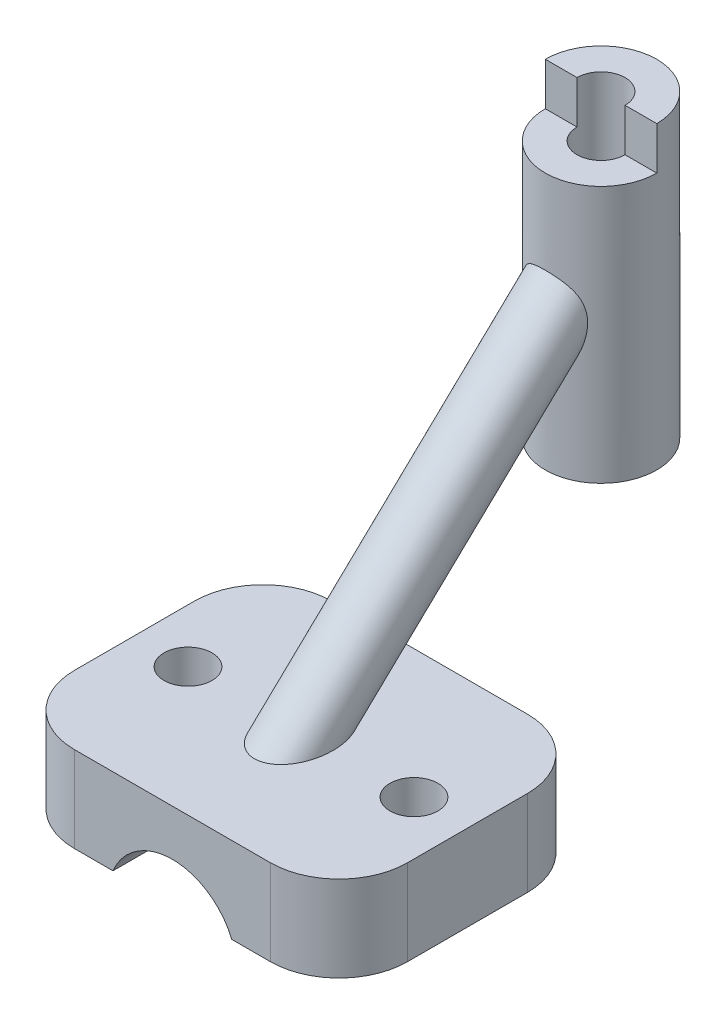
ISO-10303-21;
HEADER;
FILE_DESCRIPTION(('STEP AP214'),'2;1');
FILE_NAME('part.step','',(''),(''),'','','');
FILE_SCHEMA(('AUTOMOTIVE_DESIGN { 1 0 10303 214 1 1 1 1 }'));
ENDSEC;
DATA;
#1=APPLICATION_CONTEXT('core data for automotive mechanical design processes');
#2=APPLICATION_PROTOCOL_DEFINITION('international standard','automotive_design',2000,#1);
#3=PRODUCT_CONTEXT('',#1,'mechanical');
#4=PRODUCT('Part','Part','',(#3));
#5=PRODUCT_RELATED_PRODUCT_CATEGORY('part','',(#4));
#6=PRODUCT_DEFINITION_FORMATION('','',#4);
#7=PRODUCT_DEFINITION_CONTEXT('part definition',#1,'design');
#8=PRODUCT_DEFINITION('design','',#6,#7);
#9=PRODUCT_DEFINITION_SHAPE('','',#8);
#10=(LENGTH_UNIT() NAMED_UNIT(*) SI_UNIT(.MILLI.,.METRE.));
#11=(NAMED_UNIT(*) PLANE_ANGLE_UNIT() SI_UNIT($,.RADIAN.));
#12=(NAMED_UNIT(*) SI_UNIT($,.STERADIAN.) SOLID_ANGLE_UNIT());
#13=UNCERTAINTY_MEASURE_WITH_UNIT(LENGTH_MEASURE(1.E-05),#10,'distance_accuracy_value','');
#14=(GEOMETRIC_REPRESENTATION_CONTEXT(3) GLOBAL_UNCERTAINTY_ASSIGNED_CONTEXT((#13)) GLOBAL_UNIT_ASSIGNED_CONTEXT((#10,
#11,#12)) REPRESENTATION_CONTEXT('',''));
#15=CARTESIAN_POINT('',(0.,0.,0.));
#16=DIRECTION('',(0.,0.,1.));
#17=DIRECTION('',(1.,0.,0.));
#18=AXIS2_PLACEMENT_3D('',#15,#16,#17);
#19=CARTESIAN_POINT('',(-24.67495254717,0.,38.1));
#20=DIRECTION('',(1.,0.,0.));
#21=DIRECTION('',(0.,0.,-1.));
#22=AXIS2_PLACEMENT_3D('',#19,#20,#21);
#23=PLANE('',#22);
#24=DIRECTION('',(0.,0.,-1.));
#25=VECTOR('',#24,1.);
#26=CARTESIAN_POINT('',(-24.67495254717,0.,38.1));
#27=LINE('',#26,#25);
#28=CARTESIAN_POINT('',(-24.67495254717,0.,27.94));
#29=VERTEX_POINT('',#28);
#30=CARTESIAN_POINT('',(-24.67495254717,0.,10.16));
#31=VERTEX_POINT('',#30);
#32=EDGE_CURVE('E309',#29,#31,#27,.T.);
#33=ORIENTED_EDGE('',*,*,#32,.T.);
#34=DIRECTION('',(0.,-1.,0.));
#35=VECTOR('',#34,1.);
#36=CARTESIAN_POINT('',(-24.67495254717,-12.7,10.16));
#37=LINE('',#36,#35);
#38=CARTESIAN_POINT('',(-24.67495254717,-12.7,10.16));
#39=VERTEX_POINT('',#38);
#40=EDGE_CURVE('E340',#31,#39,#37,.T.);
#41=ORIENTED_EDGE('',*,*,#40,.T.);
#42=DIRECTION('',(0.,0.,-1.));
#43=VECTOR('',#42,1.);
#44=CARTESIAN_POINT('',(-24.67495254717,-12.7,38.1));
#45=LINE('',#44,#43);
#46=CARTESIAN_POINT('',(-24.67495254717,-12.7,27.94));
#47=VERTEX_POINT('',#46);
#48=EDGE_CURVE('E334',#47,#39,#45,.T.);
#49=ORIENTED_EDGE('',*,*,#48,.F.);
#50=DIRECTION('',(0.,-1.,0.));
#51=VECTOR('',#50,1.);
#52=CARTESIAN_POINT('',(-24.67495254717,0.,27.94));
#53=LINE('',#52,#51);
#54=EDGE_CURVE('E337',#47,#29,#53,.F.);
#55=ORIENTED_EDGE('',*,*,#54,.T.);
#56=EDGE_LOOP('',(#33,#41,#49,#55));
#57=FACE_BOUND('',#56,.T.);
#58=ADVANCED_FACE('F41',(#57),#23,.F.);
#59=CARTESIAN_POINT('',(-24.67495254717,-12.7,38.1));
#60=DIRECTION('',(0.,1.,0.));
#61=DIRECTION('',(0.,0.,1.));
#62=AXIS2_PLACEMENT_3D('',#59,#60,#61);
#63=PLANE('',#62);
#64=CARTESIAN_POINT('',(-16.73745254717,-12.7,19.05));
#65=DIRECTION('',(0.,-1.,0.));
#66=DIRECTION('',(0.,0.,-1.));
#67=AXIS2_PLACEMENT_3D('',#64,#65,#66);
#68=CIRCLE('',#67,3.556);
#69=CARTESIAN_POINT('',(-16.73745254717,-12.7,15.494));
#70=VERTEX_POINT('',#69);
#71=EDGE_CURVE('E437',#70,#70,#68,.T.);
#72=ORIENTED_EDGE('',*,*,#71,.F.);
#73=EDGE_LOOP('',(#72));
#74=FACE_BOUND('',#73,.T.);
#75=ORIENTED_EDGE('',*,*,#48,.T.);
#76=CARTESIAN_POINT('',(-14.51495254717,-12.7,10.16));
#77=DIRECTION('',(0.,1.,0.));
#78=DIRECTION('',(0.,0.,1.));
#79=AXIS2_PLACEMENT_3D('',#76,#77,#78);
#80=CIRCLE('',#79,10.16);
#81=CARTESIAN_POINT('',(-14.51495254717,-12.7,0.));
#82=VERTEX_POINT('',#81);
#83=EDGE_CURVE('E346',#39,#82,#80,.F.);
#84=ORIENTED_EDGE('',*,*,#83,.T.);
#85=DIRECTION('',(1.,0.,0.));
#86=VECTOR('',#85,1.);
#87=CARTESIAN_POINT('',(-24.67495254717,-12.7,0.));
#88=LINE('',#87,#86);
#89=CARTESIAN_POINT('',(-8.79995254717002,-12.7,0.));
#90=VERTEX_POINT('',#89);
#91=EDGE_CURVE('E310',#82,#90,#88,.T.);
#92=ORIENTED_EDGE('',*,*,#91,.T.);
#93=DIRECTION('',(0.,0.,-1.));
#94=VECTOR('',#93,1.);
#95=CARTESIAN_POINT('',(-8.79995254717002,-12.7,38.1));
#96=LINE('',#95,#94);
#97=CARTESIAN_POINT('',(-8.79995254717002,-12.7,38.1));
#98=VERTEX_POINT('',#97);
#99=EDGE_CURVE('E288',#98,#90,#96,.T.);
#100=ORIENTED_EDGE('',*,*,#99,.F.);
#101=DIRECTION('',(1.,0.,0.));
#102=VECTOR('',#101,1.);
#103=CARTESIAN_POINT('',(-24.67495254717,-12.7,38.1));
#104=LINE('',#103,#102);
#105=CARTESIAN_POINT('',(-14.51495254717,-12.7,38.1));
#106=VERTEX_POINT('',#105);
#107=EDGE_CURVE('E278',#106,#98,#104,.T.);
#108=ORIENTED_EDGE('',*,*,#107,.F.);
#109=CARTESIAN_POINT('',(-14.51495254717,-12.7,27.94));
#110=DIRECTION('',(0.,1.,0.));
#111=DIRECTION('',(0.,0.,1.));
#112=AXIS2_PLACEMENT_3D('',#109,#110,#111);
#113=CIRCLE('',#112,10.16);
#114=EDGE_CURVE('E285',#106,#47,#113,.F.);
#115=ORIENTED_EDGE('',*,*,#114,.T.);
#116=EDGE_LOOP('',(#75,#84,#92,#100,#108,#115));
#117=FACE_BOUND('',#116,.T.);
#118=ADVANCED_FACE('F238',(#74,#117),#63,.F.);
#119=CARTESIAN_POINT('',(0.,-16.3450596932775,38.1));
#120=DIRECTION('',(0.,0.,-1.));
#121=DIRECTION('',(-1.,0.,0.));
#122=AXIS2_PLACEMENT_3D('',#119,#120,#121);
#123=CYLINDRICAL_SURFACE('',#122,9.525);
#124=CARTESIAN_POINT('',(0.,-16.3450596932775,0.));
#125=DIRECTION('',(0.,0.,-1.));
#126=DIRECTION('',(-1.,0.,0.));
#127=AXIS2_PLACEMENT_3D('',#124,#125,#126);
#128=CIRCLE('',#127,9.525);
#129=CARTESIAN_POINT('',(8.79995254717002,-12.7,0.));
#130=VERTEX_POINT('',#129);
#131=EDGE_CURVE('E313',#90,#130,#128,.T.);
#132=ORIENTED_EDGE('',*,*,#131,.T.);
#133=DIRECTION('',(0.,0.,-1.));
#134=VECTOR('',#133,1.);
#135=CARTESIAN_POINT('',(8.79995254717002,-12.7,38.1));
#136=LINE('',#135,#134);
#137=CARTESIAN_POINT('',(8.79995254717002,-12.7,38.1));
#138=VERTEX_POINT('',#137);
#139=EDGE_CURVE('E328',#138,#130,#136,.T.);
#140=ORIENTED_EDGE('',*,*,#139,.F.);
#141=CARTESIAN_POINT('',(0.,-16.3450596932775,38.1));
#142=DIRECTION('',(0.,0.,-1.));
#143=DIRECTION('',(-1.,0.,0.));
#144=AXIS2_PLACEMENT_3D('',#141,#142,#143);
#145=CIRCLE('',#144,9.525);
#146=EDGE_CURVE('E291',#98,#138,#145,.T.);
#147=ORIENTED_EDGE('',*,*,#146,.F.);
#148=ORIENTED_EDGE('',*,*,#99,.T.);
#149=EDGE_LOOP('',(#132,#140,#147,#148));
#150=FACE_BOUND('',#149,.T.);
#151=ADVANCED_FACE('F244',(#150),#123,.F.);
#152=CARTESIAN_POINT('',(24.67495254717,-12.7,38.1));
#153=DIRECTION('',(0.,1.,0.));
#154=DIRECTION('',(0.,0.,1.));
#155=AXIS2_PLACEMENT_3D('',#152,#153,#154);
#156=PLANE('',#155);
#157=CARTESIAN_POINT('',(16.73745254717,-12.7,19.05));
#158=DIRECTION('',(0.,-1.,0.));
#159=DIRECTION('',(0.,0.,1.));
#160=AXIS2_PLACEMENT_3D('',#157,#158,#159);
#161=CIRCLE('',#160,3.556);
#162=CARTESIAN_POINT('',(16.73745254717,-12.7,22.606));
#163=VERTEX_POINT('',#162);
#164=EDGE_CURVE('E432',#163,#163,#161,.T.);
#165=ORIENTED_EDGE('',*,*,#164,.F.);
#166=EDGE_LOOP('',(#165));
#167=FACE_BOUND('',#166,.T.);
#168=DIRECTION('',(1.,0.,0.));
#169=VECTOR('',#168,1.);
#170=CARTESIAN_POINT('',(24.67495254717,-12.7,0.));
#171=LINE('',#170,#169);
#172=CARTESIAN_POINT('',(14.51495254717,-12.7,0.));
#173=VERTEX_POINT('',#172);
#174=EDGE_CURVE('E299',#130,#173,#171,.T.);
#175=ORIENTED_EDGE('',*,*,#174,.T.);
#176=CARTESIAN_POINT('',(14.51495254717,-12.7,10.16));
#177=DIRECTION('',(0.,1.,0.));
#178=DIRECTION('',(0.,0.,1.));
#179=AXIS2_PLACEMENT_3D('',#176,#177,#178);
#180=CIRCLE('',#179,10.16);
#181=CARTESIAN_POINT('',(24.67495254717,-12.7,10.16));
#182=VERTEX_POINT('',#181);
#183=EDGE_CURVE('E63',#173,#182,#180,.F.);
#184=ORIENTED_EDGE('',*,*,#183,.T.);
#185=DIRECTION('',(0.,0.,-1.));
#186=VECTOR('',#185,1.);
#187=CARTESIAN_POINT('',(24.67495254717,-12.7,38.1));
#188=LINE('',#187,#186);
#189=CARTESIAN_POINT('',(24.67495254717,-12.7,27.94));
#190=VERTEX_POINT('',#189);
#191=EDGE_CURVE('E325',#190,#182,#188,.T.);
#192=ORIENTED_EDGE('',*,*,#191,.F.);
#193=CARTESIAN_POINT('',(14.51495254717,-12.7,27.94));
#194=DIRECTION('',(0.,1.,0.));
#195=DIRECTION('',(0.,0.,1.));
#196=AXIS2_PLACEMENT_3D('',#193,#194,#195);
#197=CIRCLE('',#196,10.16);
#198=CARTESIAN_POINT('',(14.51495254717,-12.7,38.1));
#199=VERTEX_POINT('',#198);
#200=EDGE_CURVE('E57',#190,#199,#197,.F.);
#201=ORIENTED_EDGE('',*,*,#200,.T.);
#202=DIRECTION('',(1.,0.,0.));
#203=VECTOR('',#202,1.);
#204=CARTESIAN_POINT('',(24.67495254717,-12.7,38.1));
#205=LINE('',#204,#203);
#206=EDGE_CURVE('E296',#138,#199,#205,.T.);
#207=ORIENTED_EDGE('',*,*,#206,.F.);
#208=ORIENTED_EDGE('',*,*,#139,.T.);
#209=EDGE_LOOP('',(#175,#184,#192,#201,#207,#208));
#210=FACE_BOUND('',#209,.T.);
#211=ADVANCED_FACE('F371',(#167,#210),#156,.F.);
#212=CARTESIAN_POINT('',(24.67495254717,0.,38.1));
#213=DIRECTION('',(-1.,0.,0.));
#214=DIRECTION('',(0.,0.,1.));
#215=AXIS2_PLACEMENT_3D('',#212,#213,#214);
#216=PLANE('',#215);
#217=ORIENTED_EDGE('',*,*,#191,.T.);
#218=DIRECTION('',(0.,1.,0.));
#219=VECTOR('',#218,1.);
#220=CARTESIAN_POINT('',(24.67495254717,0.,10.16));
#221=LINE('',#220,#219);
#222=CARTESIAN_POINT('',(24.67495254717,0.,10.16));
#223=VERTEX_POINT('',#222);
#224=EDGE_CURVE('E263',#182,#223,#221,.T.);
#225=ORIENTED_EDGE('',*,*,#224,.T.);
#226=DIRECTION('',(0.,0.,-1.));
#227=VECTOR('',#226,1.);
#228=CARTESIAN_POINT('',(24.67495254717,0.,38.1));
#229=LINE('',#228,#227);
#230=CARTESIAN_POINT('',(24.67495254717,0.,27.94));
#231=VERTEX_POINT('',#230);
#232=EDGE_CURVE('E321',#231,#223,#229,.T.);
#233=ORIENTED_EDGE('',*,*,#232,.F.);
#234=DIRECTION('',(0.,1.,0.));
#235=VECTOR('',#234,1.);
#236=CARTESIAN_POINT('',(24.67495254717,0.,27.94));
#237=LINE('',#236,#235);
#238=EDGE_CURVE('E261',#231,#190,#237,.F.);
#239=ORIENTED_EDGE('',*,*,#238,.T.);
#240=EDGE_LOOP('',(#217,#225,#233,#239));
#241=FACE_BOUND('',#240,.T.);
#242=ADVANCED_FACE('F369',(#241),#216,.F.);
#243=CARTESIAN_POINT('',(-24.67495254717,0.,38.1));
#244=DIRECTION('',(0.,-1.,0.));
#245=DIRECTION('',(1.,0.,0.));
#246=AXIS2_PLACEMENT_3D('',#243,#244,#245);
#247=PLANE('',#246);
#248=CARTESIAN_POINT('',(0.,0.,19.05));
#249=DIRECTION('',(0.,-1.,0.));
#250=DIRECTION('',(0.,0.,-1.));
#251=AXIS2_PLACEMENT_3D('',#248,#249,#250);
#252=ELLIPSE('',#251,6.89802136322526,4.7625);
#253=CARTESIAN_POINT('',(0.,0.,12.1519786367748));
#254=VERTEX_POINT('',#253);
#255=EDGE_CURVE('E202',#254,#254,#252,.F.);
#256=ORIENTED_EDGE('',*,*,#255,.F.);
#257=EDGE_LOOP('',(#256));
#258=FACE_BOUND('',#257,.T.);
#259=CARTESIAN_POINT('',(-16.73745254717,0.,19.05));
#260=DIRECTION('',(0.,-1.,0.));
#261=DIRECTION('',(1.,0.,0.));
#262=AXIS2_PLACEMENT_3D('',#259,#260,#261);
#263=CIRCLE('',#262,3.556);
#264=CARTESIAN_POINT('',(-13.18145254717,0.,19.05));
#265=VERTEX_POINT('',#264);
#266=EDGE_CURVE('E314',#265,#265,#263,.F.);
#267=ORIENTED_EDGE('',*,*,#266,.F.);
#268=EDGE_LOOP('',(#267));
#269=FACE_BOUND('',#268,.T.);
#270=CARTESIAN_POINT('',(16.73745254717,0.,19.05));
#271=DIRECTION('',(0.,-1.,0.));
#272=DIRECTION('',(1.,0.,0.));
#273=AXIS2_PLACEMENT_3D('',#270,#271,#272);
#274=CIRCLE('',#273,3.556);
#275=CARTESIAN_POINT('',(20.29345254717,0.,19.05));
#276=VERTEX_POINT('',#275);
#277=EDGE_CURVE('E302',#276,#276,#274,.F.);
#278=ORIENTED_EDGE('',*,*,#277,.F.);
#279=EDGE_LOOP('',(#278));
#280=FACE_BOUND('',#279,.T.);
#281=DIRECTION('',(-1.,0.,0.));
#282=VECTOR('',#281,1.);
#283=CARTESIAN_POINT('',(-24.67495254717,0.,0.));
#284=LINE('',#283,#282);
#285=CARTESIAN_POINT('',(14.51495254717,0.,0.));
#286=VERTEX_POINT('',#285);
#287=CARTESIAN_POINT('',(-14.51495254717,0.,0.));
#288=VERTEX_POINT('',#287);
#289=EDGE_CURVE('E292',#286,#288,#284,.T.);
#290=ORIENTED_EDGE('',*,*,#289,.T.);
#291=CARTESIAN_POINT('',(-14.51495254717,0.,10.16));
#292=DIRECTION('',(0.,-1.,0.));
#293=DIRECTION('',(1.,0.,0.));
#294=AXIS2_PLACEMENT_3D('',#291,#292,#293);
#295=CIRCLE('',#294,10.16);
#296=EDGE_CURVE('E364',#288,#31,#295,.F.);
#297=ORIENTED_EDGE('',*,*,#296,.T.);
#298=ORIENTED_EDGE('',*,*,#32,.F.);
#299=CARTESIAN_POINT('',(-14.51495254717,0.,27.94));
#300=DIRECTION('',(0.,-1.,0.));
#301=DIRECTION('',(1.,0.,0.));
#302=AXIS2_PLACEMENT_3D('',#299,#300,#301);
#303=CIRCLE('',#302,10.16);
#304=CARTESIAN_POINT('',(-14.51495254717,0.,38.1));
#305=VERTEX_POINT('',#304);
#306=EDGE_CURVE('E355',#29,#305,#303,.F.);
#307=ORIENTED_EDGE('',*,*,#306,.T.);
#308=DIRECTION('',(-1.,0.,0.));
#309=VECTOR('',#308,1.);
#310=CARTESIAN_POINT('',(-24.67495254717,0.,38.1));
#311=LINE('',#310,#309);
#312=CARTESIAN_POINT('',(14.51495254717,0.,38.1));
#313=VERTEX_POINT('',#312);
#314=EDGE_CURVE('E281',#313,#305,#311,.T.);
#315=ORIENTED_EDGE('',*,*,#314,.F.);
#316=CARTESIAN_POINT('',(14.51495254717,0.,27.94));
#317=DIRECTION('',(0.,-1.,0.));
#318=DIRECTION('',(1.,0.,0.));
#319=AXIS2_PLACEMENT_3D('',#316,#317,#318);
#320=CIRCLE('',#319,10.16);
#321=EDGE_CURVE('E358',#313,#231,#320,.F.);
#322=ORIENTED_EDGE('',*,*,#321,.T.);
#323=ORIENTED_EDGE('',*,*,#232,.T.);
#324=CARTESIAN_POINT('',(14.51495254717,0.,10.16));
#325=DIRECTION('',(0.,-1.,0.));
#326=DIRECTION('',(1.,0.,0.));
#327=AXIS2_PLACEMENT_3D('',#324,#325,#326);
#328=CIRCLE('',#327,10.16);
#329=EDGE_CURVE('E361',#223,#286,#328,.F.);
#330=ORIENTED_EDGE('',*,*,#329,.T.);
#331=EDGE_LOOP('',(#290,#297,#298,#307,#315,#322,#323,#330));
#332=FACE_BOUND('',#331,.T.);
#333=ADVANCED_FACE('F380',(#258,#269,#280,#332),#247,.F.);
#334=CARTESIAN_POINT('',(0.,-16.3450596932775,38.1));
#335=DIRECTION('',(0.,0.,-1.));
#336=DIRECTION('',(-1.,0.,0.));
#337=AXIS2_PLACEMENT_3D('',#334,#335,#336);
#338=PLANE('',#337);
#339=ORIENTED_EDGE('',*,*,#206,.T.);
#340=DIRECTION('',(0.,1.,0.));
#341=VECTOR('',#340,1.);
#342=CARTESIAN_POINT('',(14.51495254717,-16.3450596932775,38.1));
#343=LINE('',#342,#341);
#344=EDGE_CURVE('E11',#199,#313,#343,.T.);
#345=ORIENTED_EDGE('',*,*,#344,.T.);
#346=ORIENTED_EDGE('',*,*,#314,.T.);
#347=DIRECTION('',(0.,-1.,0.));
#348=VECTOR('',#347,1.);
#349=CARTESIAN_POINT('',(-14.51495254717,-16.3450596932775,38.1));
#350=LINE('',#349,#348);
#351=EDGE_CURVE('E50',#305,#106,#350,.T.);
#352=ORIENTED_EDGE('',*,*,#351,.T.);
#353=ORIENTED_EDGE('',*,*,#107,.T.);
#354=ORIENTED_EDGE('',*,*,#146,.T.);
#355=EDGE_LOOP('',(#339,#345,#346,#352,#353,#354));
#356=FACE_BOUND('',#355,.T.);
#357=ADVANCED_FACE('F277',(#356),#338,.F.);
#358=CARTESIAN_POINT('',(0.,-16.3450596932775,0.));
#359=DIRECTION('',(0.,0.,-1.));
#360=DIRECTION('',(-1.,0.,0.));
#361=AXIS2_PLACEMENT_3D('',#358,#359,#360);
#362=PLANE('',#361);
#363=ORIENTED_EDGE('',*,*,#91,.F.);
#364=DIRECTION('',(0.,-1.,0.));
#365=VECTOR('',#364,1.);
#366=CARTESIAN_POINT('',(-14.51495254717,0.,0.));
#367=LINE('',#366,#365);
#368=EDGE_CURVE('E352',#82,#288,#367,.F.);
#369=ORIENTED_EDGE('',*,*,#368,.T.);
#370=ORIENTED_EDGE('',*,*,#289,.F.);
#371=DIRECTION('',(0.,1.,0.));
#372=VECTOR('',#371,1.);
#373=CARTESIAN_POINT('',(14.51495254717,-12.7,0.));
#374=LINE('',#373,#372);
#375=EDGE_CURVE('E349',#286,#173,#374,.F.);
#376=ORIENTED_EDGE('',*,*,#375,.T.);
#377=ORIENTED_EDGE('',*,*,#174,.F.);
#378=ORIENTED_EDGE('',*,*,#131,.F.);
#379=EDGE_LOOP('',(#363,#369,#370,#376,#377,#378));
#380=FACE_BOUND('',#379,.T.);
#381=ADVANCED_FACE('F388',(#380),#362,.T.);
#382=CARTESIAN_POINT('',(16.73745254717,0.000999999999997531,19.05));
#383=DIRECTION('',(0.,-1.,0.));
#384=DIRECTION('',(0.,0.,-1.));
#385=AXIS2_PLACEMENT_3D('',#382,#383,#384);
#386=CYLINDRICAL_SURFACE('',#385,3.556);
#387=ORIENTED_EDGE('',*,*,#164,.T.);
#388=EDGE_LOOP('',(#387));
#389=FACE_BOUND('',#388,.T.);
#390=ORIENTED_EDGE('',*,*,#277,.T.);
#391=EDGE_LOOP('',(#390));
#392=FACE_BOUND('',#391,.T.);
#393=ADVANCED_FACE('F391',(#389,#392),#386,.F.);
#394=CARTESIAN_POINT('',(-16.73745254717,0.000999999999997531,19.05));
#395=DIRECTION('',(0.,-1.,0.));
#396=DIRECTION('',(0.,0.,-1.));
#397=AXIS2_PLACEMENT_3D('',#394,#395,#396);
#398=CYLINDRICAL_SURFACE('',#397,3.556);
#399=ORIENTED_EDGE('',*,*,#71,.T.);
#400=EDGE_LOOP('',(#399));
#401=FACE_BOUND('',#400,.T.);
#402=ORIENTED_EDGE('',*,*,#266,.T.);
#403=EDGE_LOOP('',(#402));
#404=FACE_BOUND('',#403,.T.);
#405=ADVANCED_FACE('F397',(#401,#404),#398,.F.);
#406=CARTESIAN_POINT('',(0.,-15.569761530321,35.3639045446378));
#407=DIRECTION('',(0.,0.690415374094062,-0.723413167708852));
#408=DIRECTION('',(0.,0.723413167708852,0.690415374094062));
#409=AXIS2_PLACEMENT_3D('',#406,#407,#408);
#410=CYLINDRICAL_SURFACE('',#409,4.7625);
#411=ORIENTED_EDGE('',*,*,#255,.T.);
#412=EDGE_LOOP('',(#411));
#413=FACE_BOUND('',#412,.T.);
#414=CARTESIAN_POINT('',(0.,27.9606252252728,-17.145));
#415=CARTESIAN_POINT('',(-0.143002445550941,27.9606405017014,-17.1450049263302));
#416=CARTESIAN_POINT('',(-0.286241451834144,27.973227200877,-17.1487650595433));
#417=CARTESIAN_POINT('',(-0.56834270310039,28.0222470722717,-17.1633670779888));
#418=CARTESIAN_POINT('',(-0.707192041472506,28.0587447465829,-17.1742281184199));
#419=CARTESIAN_POINT('',(-1.00992237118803,28.1635648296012,-17.205275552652));
#420=CARTESIAN_POINT('',(-1.17168538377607,28.2374660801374,-17.2270868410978));
#421=CARTESIAN_POINT('',(-1.48069049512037,28.4092421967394,-17.2773615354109));
#422=CARTESIAN_POINT('',(-1.62790786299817,28.5071569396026,-17.3058360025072));
#423=CARTESIAN_POINT('',(-1.87952793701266,28.6988615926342,-17.36100431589));
#424=CARTESIAN_POINT('',(-1.98657333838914,28.7894919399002,-17.3868966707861));
#425=CARTESIAN_POINT('',(-2.19211253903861,28.9795152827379,-17.4406681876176));
#426=CARTESIAN_POINT('',(-2.29060088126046,29.078913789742,-17.4685485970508));
#427=CARTESIAN_POINT('',(-2.47981172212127,29.2847487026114,-17.5256529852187));
#428=CARTESIAN_POINT('',(-2.57052090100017,29.3911966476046,-17.5548791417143));
#429=CARTESIAN_POINT('',(-2.74471737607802,29.6096631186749,-17.6141150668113));
#430=CARTESIAN_POINT('',(-2.82820196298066,29.7216837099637,-17.6441251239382));
#431=CARTESIAN_POINT('',(-3.05607689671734,30.0464509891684,-17.7299019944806));
#432=CARTESIAN_POINT('',(-3.19259622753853,30.2646278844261,-17.7860904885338));
#433=CARTESIAN_POINT('',(-3.44644717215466,30.7121416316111,-17.8975871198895));
#434=CARTESIAN_POINT('',(-3.56376250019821,30.9414877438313,-17.9528944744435));
#435=CARTESIAN_POINT('',(-3.78158481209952,31.4094511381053,-18.0610995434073));
#436=CARTESIAN_POINT('',(-3.88203813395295,31.6480951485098,-18.1139891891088));
#437=CARTESIAN_POINT('',(-4.06695476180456,32.1322459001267,-18.2155715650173));
#438=CARTESIAN_POINT('',(-4.15142314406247,32.3777504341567,-18.2642656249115));
#439=CARTESIAN_POINT('',(-4.31174611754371,32.8965279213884,-18.3598771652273));
#440=CARTESIAN_POINT('',(-4.38618287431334,33.1703395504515,-18.4062587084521));
#441=CARTESIAN_POINT('',(-4.51657410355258,33.7238918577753,-18.4897484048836));
#442=CARTESIAN_POINT('',(-4.57252018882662,34.003635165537,-18.526852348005));
#443=CARTESIAN_POINT('',(-4.66425600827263,34.5665881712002,-18.5887746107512));
#444=CARTESIAN_POINT('',(-4.70012944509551,34.8497783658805,-18.6136438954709));
#445=CARTESIAN_POINT('',(-4.74929964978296,35.4189764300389,-18.6479518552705));
#446=CARTESIAN_POINT('',(-4.76262013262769,35.7049810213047,-18.6574067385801));
#447=CARTESIAN_POINT('',(-4.76243653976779,36.139428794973,-18.6572871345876));
#448=CARTESIAN_POINT('',(-4.75874877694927,36.2879124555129,-18.654675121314));
#449=CARTESIAN_POINT('',(-4.74333038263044,36.584237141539,-18.6438215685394));
#450=CARTESIAN_POINT('',(-4.73160253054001,36.7320783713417,-18.6355819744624));
#451=CARTESIAN_POINT('',(-4.6992518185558,37.0262691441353,-18.6130680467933));
#452=CARTESIAN_POINT('',(-4.67863338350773,37.172619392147,-18.5987967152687));
#453=CARTESIAN_POINT('',(-4.62759144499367,37.4628725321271,-18.5639645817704));
#454=CARTESIAN_POINT('',(-4.59716778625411,37.6067753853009,-18.5434036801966));
#455=CARTESIAN_POINT('',(-4.52519925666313,37.8926349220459,-18.4956908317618));
#456=CARTESIAN_POINT('',(-4.48352119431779,38.0345453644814,-18.4684603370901));
#457=CARTESIAN_POINT('',(-4.3884658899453,38.3130725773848,-18.4078926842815));
#458=CARTESIAN_POINT('',(-4.33508884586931,38.449689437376,-18.3745556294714));
#459=CARTESIAN_POINT('',(-4.21619647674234,38.7159615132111,-18.3025686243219));
#460=CARTESIAN_POINT('',(-4.15069022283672,38.8456218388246,-18.2639226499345));
#461=CARTESIAN_POINT('',(-4.00739274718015,39.0965787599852,-18.1824791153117));
#462=CARTESIAN_POINT('',(-3.92960327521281,39.2178765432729,-18.1396821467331));
#463=CARTESIAN_POINT('',(-3.77346177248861,39.4349194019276,-18.0574736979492));
#464=CARTESIAN_POINT('',(-3.69663443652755,39.5318928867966,-18.0183969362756));
#465=CARTESIAN_POINT('',(-3.53441676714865,39.7180032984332,-17.9393660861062));
#466=CARTESIAN_POINT('',(-3.44902674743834,39.8071405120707,-17.8994120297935));
#467=CARTESIAN_POINT('',(-3.27021605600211,39.9771183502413,-17.8197432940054));
#468=CARTESIAN_POINT('',(-3.17679344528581,40.0579569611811,-17.7800286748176));
#469=CARTESIAN_POINT('',(-2.98260601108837,40.2110021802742,-17.701946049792));
#470=CARTESIAN_POINT('',(-2.88184115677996,40.2832087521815,-17.6635780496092));
#471=CARTESIAN_POINT('',(-2.67883228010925,40.41548091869,-17.5910354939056));
#472=CARTESIAN_POINT('',(-2.57690278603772,40.4759681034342,-17.5567475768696));
#473=CARTESIAN_POINT('',(-2.36774775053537,40.5889156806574,-17.4910928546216));
#474=CARTESIAN_POINT('',(-2.2605205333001,40.6413735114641,-17.4597269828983));
#475=CARTESIAN_POINT('',(-2.04156409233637,40.7381966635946,-17.4006316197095));
#476=CARTESIAN_POINT('',(-1.9298366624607,40.7825651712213,-17.3729006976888));
#477=CARTESIAN_POINT('',(-1.70253352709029,40.8632592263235,-17.3216348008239));
#478=CARTESIAN_POINT('',(-1.58695639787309,40.8995817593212,-17.2981013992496));
#479=CARTESIAN_POINT('',(-1.34750290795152,40.9656306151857,-17.2547734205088));
#480=CARTESIAN_POINT('',(-1.22348642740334,40.9949898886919,-17.2351927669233));
#481=CARTESIAN_POINT('',(-0.972924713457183,41.0449736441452,-17.2015594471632));
#482=CARTESIAN_POINT('',(-0.846378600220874,41.0655950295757,-17.1875087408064));
#483=CARTESIAN_POINT('',(-0.591664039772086,41.098115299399,-17.165238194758));
#484=CARTESIAN_POINT('',(-0.463495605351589,41.1100142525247,-17.1570183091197));
#485=CARTESIAN_POINT('',(-0.206403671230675,41.1251070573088,-17.1465779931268));
#486=CARTESIAN_POINT('',(-0.077480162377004,41.1283008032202,-17.1443576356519));
#487=CARTESIAN_POINT('',(0.183287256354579,41.1259603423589,-17.1459811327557));
#488=CARTESIAN_POINT('',(0.315128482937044,41.1202189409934,-17.1499689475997));
#489=CARTESIAN_POINT('',(0.577712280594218,41.0996154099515,-17.1641906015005));
#490=CARTESIAN_POINT('',(0.70845520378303,41.0847563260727,-17.1744223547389));
#491=CARTESIAN_POINT('',(0.968019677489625,41.0458890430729,-17.200915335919));
#492=CARTESIAN_POINT('',(1.09684029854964,41.0218765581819,-17.2171793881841));
#493=CARTESIAN_POINT('',(1.35152184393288,40.9646828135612,-17.2553706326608));
#494=CARTESIAN_POINT('',(1.47738389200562,40.9315050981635,-17.2772956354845));
#495=CARTESIAN_POINT('',(1.72535205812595,40.8559220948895,-17.3263287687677));
#496=CARTESIAN_POINT('',(1.84745601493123,40.8135116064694,-17.3534398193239));
#497=CARTESIAN_POINT('',(2.08687625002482,40.7194690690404,-17.4121868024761));
#498=CARTESIAN_POINT('',(2.20419443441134,40.6678407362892,-17.4438209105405));
#499=CARTESIAN_POINT('',(2.43320797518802,40.5553531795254,-17.5108454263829));
#500=CARTESIAN_POINT('',(2.54490309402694,40.4944935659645,-17.5462359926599));
#501=CARTESIAN_POINT('',(2.76179778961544,40.3636048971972,-17.6198577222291));
#502=CARTESIAN_POINT('',(2.86699755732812,40.2935761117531,-17.6580888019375));
#503=CARTESIAN_POINT('',(3.0675679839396,40.1463439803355,-17.735385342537));
#504=CARTESIAN_POINT('',(3.16311751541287,40.069361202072,-17.7744067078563));
#505=CARTESIAN_POINT('',(3.34656814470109,39.9070701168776,-17.8531151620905));
#506=CARTESIAN_POINT('',(3.4344694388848,39.821762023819,-17.892802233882));
#507=CARTESIAN_POINT('',(3.6019835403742,39.643275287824,-17.9717222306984));
#508=CARTESIAN_POINT('',(3.68160131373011,39.550101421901,-18.0109554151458));
#509=CARTESIAN_POINT('',(3.83215950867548,39.3564096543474,-18.0879052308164));
#510=CARTESIAN_POINT('',(3.90310020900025,39.2558919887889,-18.1256219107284));
#511=CARTESIAN_POINT('',(4.03306920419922,39.0528904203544,-18.1969015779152));
#512=CARTESIAN_POINT('',(4.09248793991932,38.9506946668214,-18.2305748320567));
#513=CARTESIAN_POINT('',(4.20313021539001,38.7409959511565,-18.2948737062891));
#514=CARTESIAN_POINT('',(4.25435061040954,38.6334909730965,-18.3254981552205));
#515=CARTESIAN_POINT('',(4.34868153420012,38.4140537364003,-18.3830882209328));
#516=CARTESIAN_POINT('',(4.39179264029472,38.3021217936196,-18.4100540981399));
#517=CARTESIAN_POINT('',(4.47019103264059,38.0746635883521,-18.4599299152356));
#518=CARTESIAN_POINT('',(4.50547664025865,37.959136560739,-18.482838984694));
#519=CARTESIAN_POINT('',(4.57899077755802,37.6868725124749,-18.5312001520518));
#520=CARTESIAN_POINT('',(4.61437447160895,37.5290713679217,-18.5550130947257));
#521=CARTESIAN_POINT('',(4.67314220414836,37.2103062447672,-18.5950003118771));
#522=CARTESIAN_POINT('',(4.69652243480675,37.0493412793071,-18.6111721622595));
#523=CARTESIAN_POINT('',(4.73251986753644,36.7254005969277,-18.6362169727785));
#524=CARTESIAN_POINT('',(4.74511863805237,36.5624219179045,-18.6450774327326));
#525=CARTESIAN_POINT('',(4.76064206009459,36.235761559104,-18.656010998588));
#526=CARTESIAN_POINT('',(4.76356323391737,36.0720796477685,-18.6580816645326));
#527=CARTESIAN_POINT('',(4.75995189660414,35.6509695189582,-18.6555253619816));
#528=CARTESIAN_POINT('',(4.74703673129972,35.3936145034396,-18.6463761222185));
#529=CARTESIAN_POINT('',(4.70291591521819,34.8812101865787,-18.6155850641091));
#530=CARTESIAN_POINT('',(4.67169840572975,34.6261624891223,-18.5939351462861));
#531=CARTESIAN_POINT('',(4.59290169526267,34.1188544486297,-18.540513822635));
#532=CARTESIAN_POINT('',(4.54526886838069,33.8666060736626,-18.5087092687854));
#533=CARTESIAN_POINT('',(4.43486210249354,33.3666983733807,-18.4371452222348));
#534=CARTESIAN_POINT('',(4.3720920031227,33.1190379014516,-18.3973877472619));
#535=CARTESIAN_POINT('',(4.22684502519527,32.611640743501,-18.3086980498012));
#536=CARTESIAN_POINT('',(4.14328675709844,32.3522921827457,-18.2593152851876));
#537=CARTESIAN_POINT('',(3.95886968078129,31.8407238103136,-18.1554436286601));
#538=CARTESIAN_POINT('',(3.85800357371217,31.5885070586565,-18.1009525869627));
#539=CARTESIAN_POINT('',(3.63824187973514,31.0941715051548,-17.9889690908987));
#540=CARTESIAN_POINT('',(3.51943295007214,30.8520109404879,-17.9314918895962));
#541=CARTESIAN_POINT('',(3.26131370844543,30.3793541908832,-17.8152169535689));
#542=CARTESIAN_POINT('',(3.12202422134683,30.1488464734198,-17.7564206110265));
#543=CARTESIAN_POINT('',(2.84901639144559,29.7471718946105,-17.6511206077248));
#544=CARTESIAN_POINT('',(2.71950895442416,29.5731991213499,-17.6044557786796));
#545=CARTESIAN_POINT('',(2.44231039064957,29.2390055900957,-17.5132063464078));
#546=CARTESIAN_POINT('',(2.29459477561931,29.0788038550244,-17.4686246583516));
#547=CARTESIAN_POINT('',(2.05661549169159,28.8528402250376,-17.4048662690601));
#548=CARTESIAN_POINT('',(1.97399388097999,28.7795022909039,-17.3840138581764));
#549=CARTESIAN_POINT('',(1.80318551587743,28.6391803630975,-17.3438669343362));
#550=CARTESIAN_POINT('',(1.71499770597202,28.5721975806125,-17.3245727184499));
#551=CARTESIAN_POINT('',(1.44206986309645,28.3831500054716,-17.2698289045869));
#552=CARTESIAN_POINT('',(1.24832109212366,28.2723479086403,-17.2373366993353));
#553=CARTESIAN_POINT('',(0.913387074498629,28.1275417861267,-17.1946277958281));
#554=CARTESIAN_POINT('',(0.778401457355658,28.0802508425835,-17.1806030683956));
#555=CARTESIAN_POINT('',(0.502207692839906,28.0080152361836,-17.1591374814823));
#556=CARTESIAN_POINT('',(0.361020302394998,27.9830012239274,-17.1516761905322));
#557=CARTESIAN_POINT('',(0.1824706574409,27.9671114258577,-17.146935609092));
#558=CARTESIAN_POINT('',(0.146029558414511,27.9646833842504,-17.1462111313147));
#559=CARTESIAN_POINT('',(0.0730641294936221,27.9614382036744,-17.1452426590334));
#560=CARTESIAN_POINT('',(0.0365397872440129,27.9606213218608,-17.1449987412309));
#561=CARTESIAN_POINT('',(0.,27.9606252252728,-17.145));
#562=B_SPLINE_CURVE_WITH_KNOTS('',3,(#414,#415,#416,#417,#418,#419,#420,#421,#422,#423,#424,
#425,#426,#427,#428,#429,#430,#431,#432,#433,#434,#435,#436,#437,#438,#439,#440,#441,#442,#443,
#444,#445,#446,#447,#448,#449,#450,#451,#452,#453,#454,#455,#456,#457,#458,#459,#460,#461,#462,
#463,#464,#465,#466,#467,#468,#469,#470,#471,#472,#473,#474,#475,#476,#477,#478,#479,#480,#481,
#482,#483,#484,#485,#486,#487,#488,#489,#490,#491,#492,#493,#494,#495,#496,#497,#498,#499,#500,
#501,#502,#503,#504,#505,#506,#507,#508,#509,#510,#511,#512,#513,#514,#515,#516,#517,#518,#519,
#520,#521,#522,#523,#524,#525,#526,#527,#528,#529,#530,#531,#532,#533,#534,#535,#536,#537,#538,
#539,#540,#541,#542,#543,#544,#545,#546,#547,#548,#549,#550,#551,#552,#553,#554,#555,#556,#557,
#558,#559,#560,#561),.UNSPECIFIED.,.T.,.F.,(4,2,2,2,2,2,2,2,2,2,2,2,2,2,2,2,2,2,2,2,2,2,2,2,2,2,
2,2,2,2,2,2,2,2,2,2,2,2,2,2,2,2,2,2,2,2,2,2,2,2,2,2,2,2,2,2,2,2,2,2,2,2,2,2,2,2,2,2,2,2,2,2,2,
4),(0.,0.428850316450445,0.858862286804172,1.39338495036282,1.92880132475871,2.35610189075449,
2.7836729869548,3.21196214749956,3.64041123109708,4.42943207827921,5.21911861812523,
6.01127249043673,6.80317437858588,7.66495562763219,8.52712723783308,9.38567628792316,
10.2433219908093,10.6887130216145,11.1339501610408,11.5789659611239,12.0239888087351,
12.4745284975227,12.9250605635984,13.3752570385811,13.8253894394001,14.2141094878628,
14.6028153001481,14.9916152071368,15.3804167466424,15.7501631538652,16.1200272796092,
16.4897454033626,16.8596018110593,17.245976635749,17.6324882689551,18.0189968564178,
18.4055101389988,18.8011205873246,19.1965989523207,19.5922627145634,19.9877736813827,
20.383508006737,20.7790831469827,21.174674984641,21.5702551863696,21.9560410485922,
22.3418170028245,22.727360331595,23.1128912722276,23.4812095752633,23.8496688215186,
24.2181018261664,24.5866137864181,25.07625174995,25.5660449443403,26.0566738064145,
26.5474789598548,27.3197679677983,28.0925579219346,28.8678967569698,29.643039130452,
30.4731184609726,31.3035487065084,32.1300894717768,32.9557955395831,33.6204754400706,
34.2860592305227,34.6230298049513,34.9600644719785,35.6313885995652,36.0609383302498,
36.4891461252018,36.5987078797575,36.7082871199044),.UNSPECIFIED.);
#563=CARTESIAN_POINT('',(0.,27.9606252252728,-17.145));
#564=VERTEX_POINT('',#563);
#565=EDGE_CURVE('E190',#564,#564,#562,.T.);
#566=ORIENTED_EDGE('',*,*,#565,.F.);
#567=EDGE_LOOP('',(#566));
#568=FACE_BOUND('',#567,.T.);
#569=ADVANCED_FACE('F219',(#413,#568),#410,.T.);
#570=CARTESIAN_POINT('',(0.,53.594,-25.4));
#571=DIRECTION('',(0.,1.,0.));
#572=DIRECTION('',(-1.,0.,0.));
#573=AXIS2_PLACEMENT_3D('',#570,#571,#572);
#574=PLANE('',#573);
#575=DIRECTION('',(1.,0.,0.));
#576=VECTOR('',#575,1.);
#577=CARTESIAN_POINT('',(-3.556,53.594,-25.4));
#578=LINE('',#577,#576);
#579=CARTESIAN_POINT('',(-8.255,53.594,-25.4));
#580=VERTEX_POINT('',#579);
#581=CARTESIAN_POINT('',(-3.556,53.594,-25.4));
#582=VERTEX_POINT('',#581);
#583=EDGE_CURVE('E167',#580,#582,#578,.T.);
#584=ORIENTED_EDGE('',*,*,#583,.F.);
#585=CARTESIAN_POINT('',(0.,53.594,-25.4));
#586=DIRECTION('',(0.,1.,0.));
#587=DIRECTION('',(-1.,0.,0.));
#588=AXIS2_PLACEMENT_3D('',#585,#586,#587);
#589=CIRCLE('',#588,8.255);
#590=CARTESIAN_POINT('',(8.255,53.594,-25.4));
#591=VERTEX_POINT('',#590);
#592=EDGE_CURVE('E187',#580,#591,#589,.T.);
#593=ORIENTED_EDGE('',*,*,#592,.T.);
#594=DIRECTION('',(1.,0.,0.));
#595=VECTOR('',#594,1.);
#596=CARTESIAN_POINT('',(3.556,53.594,-25.4));
#597=LINE('',#596,#595);
#598=CARTESIAN_POINT('',(3.556,53.594,-25.4));
#599=VERTEX_POINT('',#598);
#600=EDGE_CURVE('E425',#599,#591,#597,.T.);
#601=ORIENTED_EDGE('',*,*,#600,.F.);
#602=CARTESIAN_POINT('',(0.,53.594,-25.4));
#603=DIRECTION('',(0.,1.,0.));
#604=DIRECTION('',(-1.,0.,0.));
#605=AXIS2_PLACEMENT_3D('',#602,#603,#604);
#606=CIRCLE('',#605,3.556);
#607=EDGE_CURVE('E172',#582,#599,#606,.T.);
#608=ORIENTED_EDGE('',*,*,#607,.F.);
#609=EDGE_LOOP('',(#584,#593,#601,#608));
#610=FACE_BOUND('',#609,.T.);
#611=ADVANCED_FACE('F215',(#610),#574,.T.);
#612=CARTESIAN_POINT('',(0.,15.494,-25.4));
#613=DIRECTION('',(0.,1.,0.));
#614=DIRECTION('',(-1.,0.,0.));
#615=AXIS2_PLACEMENT_3D('',#612,#613,#614);
#616=PLANE('',#615);
#617=CARTESIAN_POINT('',(0.,15.494,-25.4));
#618=DIRECTION('',(0.,1.,0.));
#619=DIRECTION('',(-1.,0.,0.));
#620=AXIS2_PLACEMENT_3D('',#617,#618,#619);
#621=CIRCLE('',#620,8.255);
#622=CARTESIAN_POINT('',(-8.255,15.494,-25.4));
#623=VERTEX_POINT('',#622);
#624=EDGE_CURVE('E185',#623,#623,#621,.T.);
#625=ORIENTED_EDGE('',*,*,#624,.F.);
#626=EDGE_LOOP('',(#625));
#627=FACE_BOUND('',#626,.T.);
#628=CARTESIAN_POINT('',(0.,15.494,-25.4));
#629=DIRECTION('',(0.,1.,0.));
#630=DIRECTION('',(-1.,0.,0.));
#631=AXIS2_PLACEMENT_3D('',#628,#629,#630);
#632=CIRCLE('',#631,3.556);
#633=CARTESIAN_POINT('',(-3.556,15.494,-25.4));
#634=VERTEX_POINT('',#633);
#635=EDGE_CURVE('E174',#634,#634,#632,.T.);
#636=ORIENTED_EDGE('',*,*,#635,.T.);
#637=EDGE_LOOP('',(#636));
#638=FACE_BOUND('',#637,.T.);
#639=ADVANCED_FACE('F211',(#627,#638),#616,.F.);
#640=CARTESIAN_POINT('',(0.,53.594,-25.4));
#641=DIRECTION('',(0.,-1.,0.));
#642=DIRECTION('',(1.,0.,0.));
#643=AXIS2_PLACEMENT_3D('',#640,#641,#642);
#644=CYLINDRICAL_SURFACE('',#643,8.255);
#645=ORIENTED_EDGE('',*,*,#565,.T.);
#646=EDGE_LOOP('',(#645));
#647=FACE_BOUND('',#646,.T.);
#648=ORIENTED_EDGE('',*,*,#592,.F.);
#649=DIRECTION('',(0.,-1.,0.));
#650=VECTOR('',#649,1.);
#651=CARTESIAN_POINT('',(-8.255,59.944,-25.4));
#652=LINE('',#651,#650);
#653=CARTESIAN_POINT('',(-8.255,59.944,-25.4));
#654=VERTEX_POINT('',#653);
#655=EDGE_CURVE('E180',#654,#580,#652,.T.);
#656=ORIENTED_EDGE('',*,*,#655,.F.);
#657=CARTESIAN_POINT('',(0.,59.944,-25.4));
#658=DIRECTION('',(0.,1.,0.));
#659=DIRECTION('',(1.,0.,0.));
#660=AXIS2_PLACEMENT_3D('',#657,#658,#659);
#661=CIRCLE('',#660,8.255);
#662=CARTESIAN_POINT('',(8.255,59.944,-25.4));
#663=VERTEX_POINT('',#662);
#664=EDGE_CURVE('E156',#663,#654,#661,.T.);
#665=ORIENTED_EDGE('',*,*,#664,.F.);
#666=DIRECTION('',(0.,-1.,0.));
#667=VECTOR('',#666,1.);
#668=CARTESIAN_POINT('',(8.255,59.944,-25.4));
#669=LINE('',#668,#667);
#670=EDGE_CURVE('E152',#663,#591,#669,.T.);
#671=ORIENTED_EDGE('',*,*,#670,.T.);
#672=EDGE_LOOP('',(#648,#656,#665,#671));
#673=FACE_BOUND('',#672,.T.);
#674=ORIENTED_EDGE('',*,*,#624,.T.);
#675=EDGE_LOOP('',(#674));
#676=FACE_BOUND('',#675,.T.);
#677=ADVANCED_FACE('F208',(#647,#673,#676),#644,.T.);
#678=CARTESIAN_POINT('',(0.,53.594,-25.4));
#679=DIRECTION('',(0.,-1.,0.));
#680=DIRECTION('',(1.,0.,0.));
#681=AXIS2_PLACEMENT_3D('',#678,#679,#680);
#682=CYLINDRICAL_SURFACE('',#681,3.556);
#683=ORIENTED_EDGE('',*,*,#607,.T.);
#684=DIRECTION('',(0.,-1.,0.));
#685=VECTOR('',#684,1.);
#686=CARTESIAN_POINT('',(3.556,59.944,-25.4));
#687=LINE('',#686,#685);
#688=CARTESIAN_POINT('',(3.556,59.944,-25.4));
#689=VERTEX_POINT('',#688);
#690=EDGE_CURVE('E150',#689,#599,#687,.T.);
#691=ORIENTED_EDGE('',*,*,#690,.F.);
#692=CARTESIAN_POINT('',(0.,59.944,-25.4));
#693=DIRECTION('',(0.,-1.,0.));
#694=DIRECTION('',(1.,0.,0.));
#695=AXIS2_PLACEMENT_3D('',#692,#693,#694);
#696=CIRCLE('',#695,3.556);
#697=CARTESIAN_POINT('',(-3.556,59.944,-25.4));
#698=VERTEX_POINT('',#697);
#699=EDGE_CURVE('E157',#698,#689,#696,.T.);
#700=ORIENTED_EDGE('',*,*,#699,.F.);
#701=DIRECTION('',(0.,-1.,0.));
#702=VECTOR('',#701,1.);
#703=CARTESIAN_POINT('',(-3.556,59.944,-25.4));
#704=LINE('',#703,#702);
#705=EDGE_CURVE('E419',#698,#582,#704,.T.);
#706=ORIENTED_EDGE('',*,*,#705,.T.);
#707=EDGE_LOOP('',(#683,#691,#700,#706));
#708=FACE_BOUND('',#707,.T.);
#709=ORIENTED_EDGE('',*,*,#635,.F.);
#710=EDGE_LOOP('',(#709));
#711=FACE_BOUND('',#710,.T.);
#712=ADVANCED_FACE('F170',(#708,#711),#682,.F.);
#713=CARTESIAN_POINT('',(3.556,59.944,-25.4));
#714=DIRECTION('',(0.,0.,-1.));
#715=DIRECTION('',(-1.,0.,0.));
#716=AXIS2_PLACEMENT_3D('',#713,#714,#715);
#717=PLANE('',#716);
#718=ORIENTED_EDGE('',*,*,#600,.T.);
#719=ORIENTED_EDGE('',*,*,#670,.F.);
#720=DIRECTION('',(1.,0.,0.));
#721=VECTOR('',#720,1.);
#722=CARTESIAN_POINT('',(3.556,59.944,-25.4));
#723=LINE('',#722,#721);
#724=EDGE_CURVE('E145',#689,#663,#723,.T.);
#725=ORIENTED_EDGE('',*,*,#724,.F.);
#726=ORIENTED_EDGE('',*,*,#690,.T.);
#727=EDGE_LOOP('',(#718,#719,#725,#726));
#728=FACE_BOUND('',#727,.T.);
#729=ADVANCED_FACE('F148',(#728),#717,.F.);
#730=CARTESIAN_POINT('',(-3.556,59.944,-25.4));
#731=DIRECTION('',(0.,0.,-1.));
#732=DIRECTION('',(-1.,0.,0.));
#733=AXIS2_PLACEMENT_3D('',#730,#731,#732);
#734=PLANE('',#733);
#735=ORIENTED_EDGE('',*,*,#583,.T.);
#736=ORIENTED_EDGE('',*,*,#705,.F.);
#737=DIRECTION('',(1.,0.,0.));
#738=VECTOR('',#737,1.);
#739=CARTESIAN_POINT('',(-3.556,59.944,-25.4));
#740=LINE('',#739,#738);
#741=EDGE_CURVE('E162',#654,#698,#740,.T.);
#742=ORIENTED_EDGE('',*,*,#741,.F.);
#743=ORIENTED_EDGE('',*,*,#655,.T.);
#744=EDGE_LOOP('',(#735,#736,#742,#743));
#745=FACE_BOUND('',#744,.T.);
#746=ADVANCED_FACE('F225',(#745),#734,.F.);
#747=CARTESIAN_POINT('',(0.,59.944,-25.4));
#748=DIRECTION('',(0.,-1.,0.));
#749=DIRECTION('',(1.,0.,0.));
#750=AXIS2_PLACEMENT_3D('',#747,#748,#749);
#751=PLANE('',#750);
#752=ORIENTED_EDGE('',*,*,#699,.T.);
#753=ORIENTED_EDGE('',*,*,#724,.T.);
#754=ORIENTED_EDGE('',*,*,#664,.T.);
#755=ORIENTED_EDGE('',*,*,#741,.T.);
#756=EDGE_LOOP('',(#752,#753,#754,#755));
#757=FACE_BOUND('',#756,.T.);
#758=ADVANCED_FACE('F160',(#757),#751,.F.);
#759=CARTESIAN_POINT('',(-14.51495254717,0.,10.16));
#760=DIRECTION('',(0.,1.,0.));
#761=DIRECTION('',(0.,0.,1.));
#762=AXIS2_PLACEMENT_3D('',#759,#760,#761);
#763=CYLINDRICAL_SURFACE('',#762,10.16);
#764=ORIENTED_EDGE('',*,*,#296,.F.);
#765=ORIENTED_EDGE('',*,*,#368,.F.);
#766=ORIENTED_EDGE('',*,*,#83,.F.);
#767=ORIENTED_EDGE('',*,*,#40,.F.);
#768=EDGE_LOOP('',(#764,#765,#766,#767));
#769=FACE_BOUND('',#768,.T.);
#770=ADVANCED_FACE('F230',(#769),#763,.T.);
#771=CARTESIAN_POINT('',(14.51495254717,0.,10.16));
#772=DIRECTION('',(0.,-1.,0.));
#773=DIRECTION('',(0.,0.,-1.));
#774=AXIS2_PLACEMENT_3D('',#771,#772,#773);
#775=CYLINDRICAL_SURFACE('',#774,10.16);
#776=ORIENTED_EDGE('',*,*,#183,.F.);
#777=ORIENTED_EDGE('',*,*,#375,.F.);
#778=ORIENTED_EDGE('',*,*,#329,.F.);
#779=ORIENTED_EDGE('',*,*,#224,.F.);
#780=EDGE_LOOP('',(#776,#777,#778,#779));
#781=FACE_BOUND('',#780,.T.);
#782=ADVANCED_FACE('F234',(#781),#775,.T.);
#783=CARTESIAN_POINT('',(14.51495254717,-16.3450596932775,27.94));
#784=DIRECTION('',(0.,1.,0.));
#785=DIRECTION('',(0.,0.,1.));
#786=AXIS2_PLACEMENT_3D('',#783,#784,#785);
#787=CYLINDRICAL_SURFACE('',#786,10.16);
#788=ORIENTED_EDGE('',*,*,#200,.F.);
#789=ORIENTED_EDGE('',*,*,#238,.F.);
#790=ORIENTED_EDGE('',*,*,#321,.F.);
#791=ORIENTED_EDGE('',*,*,#344,.F.);
#792=EDGE_LOOP('',(#788,#789,#790,#791));
#793=FACE_BOUND('',#792,.T.);
#794=ADVANCED_FACE('F251',(#793),#787,.T.);
#795=CARTESIAN_POINT('',(-14.51495254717,-16.3450596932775,27.94));
#796=DIRECTION('',(0.,-1.,0.));
#797=DIRECTION('',(0.,0.,-1.));
#798=AXIS2_PLACEMENT_3D('',#795,#796,#797);
#799=CYLINDRICAL_SURFACE('',#798,10.16);
#800=ORIENTED_EDGE('',*,*,#306,.F.);
#801=ORIENTED_EDGE('',*,*,#54,.F.);
#802=ORIENTED_EDGE('',*,*,#114,.F.);
#803=ORIENTED_EDGE('',*,*,#351,.F.);
#804=EDGE_LOOP('',(#800,#801,#802,#803));
#805=FACE_BOUND('',#804,.T.);
#806=ADVANCED_FACE('F43',(#805),#799,.T.);
#807=CLOSED_SHELL('',(#58,#118,#151,#211,#242,#333,#357,#381,#393,#405,#569,#611,#639,#677,#712,
#729,#746,#758,#770,#782,#794,#806));
#808=MANIFOLD_SOLID_BREP('B2',#807);
#809=ADVANCED_BREP_SHAPE_REPRESENTATION('',(#18,#808),#14);
#810=SHAPE_DEFINITION_REPRESENTATION(#9,#809);
ENDSEC;
END-ISO-10303-21;
